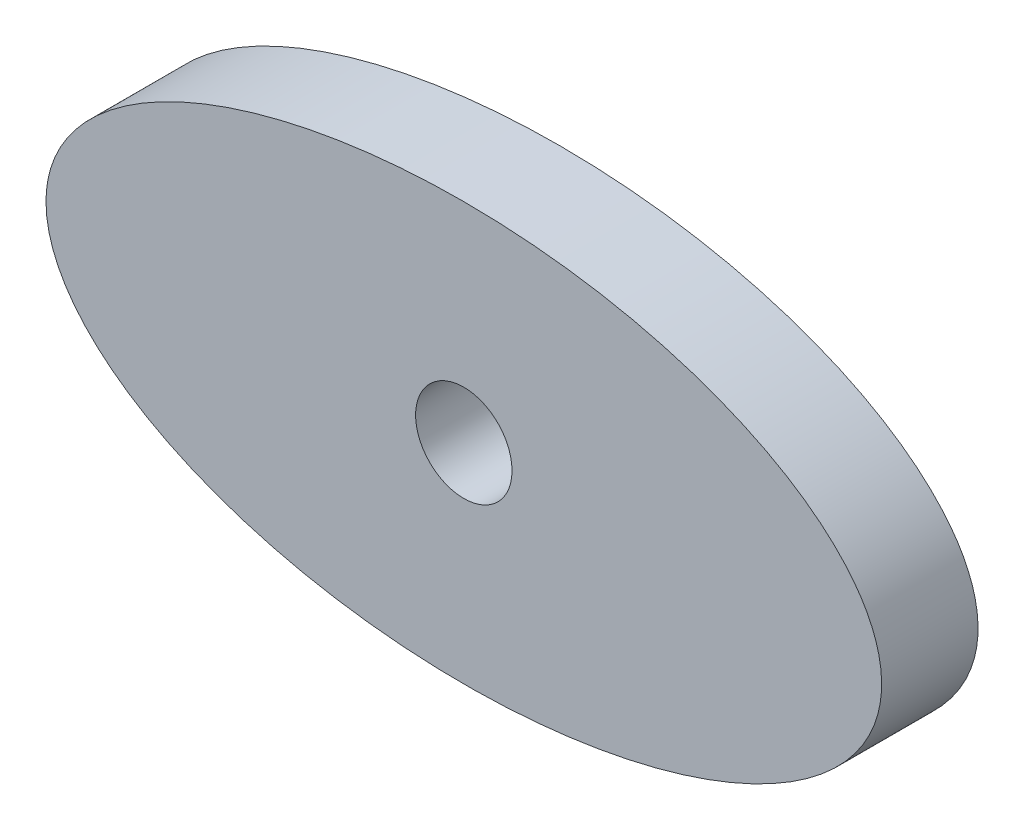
from build123d import *

# Parameters (mm, degrees)
SKIZZE1_RX              = 65
SKIZZE1_RY              = 32.5
SKIZZE1_R               = 7.5
LINEAR_AUSTRAGEN1_DEPTH = 7.5


with BuildPart() as part:
    # Skizze1 → Linear austragen1 (new, symmetric)
    with BuildSketch(Plane.XY):
        with Locations(Location((0, 0), (0, 0, 180))):
            Ellipse(SKIZZE1_RX, SKIZZE1_RY)
        Circle(SKIZZE1_R, mode=Mode.SUBTRACT)
    extrude(amount=LINEAR_AUSTRAGEN1_DEPTH, both=True)


solid = part.part
